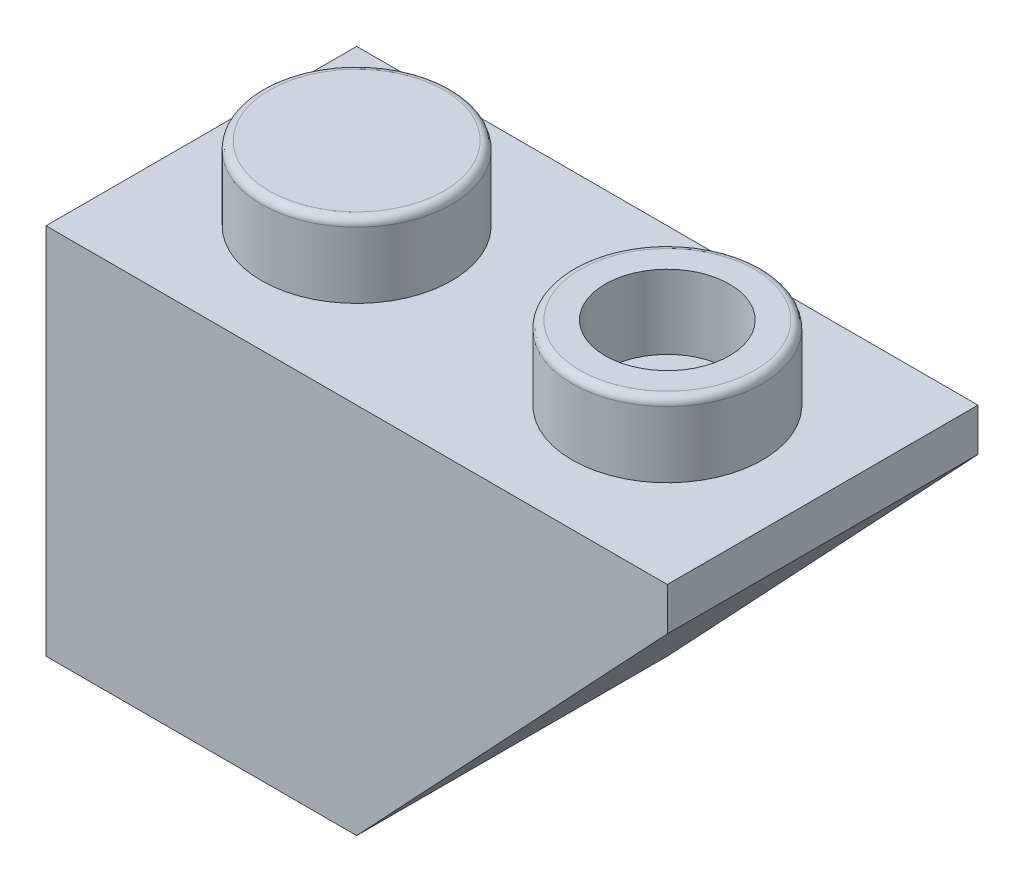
from build123d import *

# Parameters (mm, degrees)
SKIZZE1_W                       = 16
SKIZZE1_H                       = 9.6
LINEAR_AUSTRAGEN1_DEPTH         = 8
SCHNITT_LINEAR_AUSTRAGEN1_DEPTH = 8
SKIZZE3_W                       = 6.8
SKIZZE3_H                       = 6.8
SCHNITT_LINEAR_AUSTRAGEN2_DEPTH = 8.6
SKIZZE4_R                       = 2.45
LINEAR_AUSTRAGEN2_DEPTH         = 1.9
VERRUNDUNG1_R                   = 0.2
SKIZZE5_R                       = 1.25
SCHNITT_LINEAR_AUSTRAGEN3_DEPTH = 1.8
SKIZZE6_R                       = 1.6
SCHNITT_LINEAR_AUSTRAGEN4_DEPTH = 1.9
SKIZZE7_W                       = 0.5
SKIZZE7_H                       = 1
LINEAR_AUSTRAGEN3_DEPTH         = 8.2


with BuildPart() as part:
    # Skizze1 → Linear austragen1 (new body)
    with BuildSketch(Plane.XY):
        with Locations((8, 4.8)):
            Rectangle(SKIZZE1_W, SKIZZE1_H)
    extrude(amount=LINEAR_AUSTRAGEN1_DEPTH)

    # Skizze2 → Schnitt-Linear austragen1 (cut)
    with BuildSketch(Plane.XY.offset(8)):
        Polygon((16, 8.5), (8, 0), (16, 0), align=None)
    extrude(amount=-SCHNITT_LINEAR_AUSTRAGEN1_DEPTH, mode=Mode.SUBTRACT)

    # Skizze3 → Schnitt-Linear austragen2 (cut)
    with BuildSketch(Plane.XZ):
        with Locations((4, 4)):
            Rectangle(SKIZZE3_W, SKIZZE3_H)
    extrude(amount=-SCHNITT_LINEAR_AUSTRAGEN2_DEPTH, mode=Mode.SUBTRACT)

    # Skizze4 → Linear austragen2 (add)
    with BuildSketch(Plane(origin=(0, 9.6, 0), x_dir=(-1, 0, 0), z_dir=(0, 1, 0))):
        with Locations(Location((-12, 4, 0), (0, 0, 270))):
            Circle(SKIZZE4_R)
        with Locations(Location((-4, 4, 0), (0, 0, 270))):
            Circle(SKIZZE4_R)
    extrude(amount=LINEAR_AUSTRAGEN2_DEPTH)

    # Verrundung1
    verrundung1_edges = [part.edges().sort_by_distance(p)[0] for p in [
        (12, 11.5, 6.45),
        (4, 11.5, 6.45),
    ]]
    fillet(verrundung1_edges, radius=VERRUNDUNG1_R)

    # Skizze5 → Schnitt-Linear austragen3 (cut)
    with BuildSketch(Plane.XZ.offset(-8.6)):
        with Locations(Location((4, 4, 0), (0, 0, 270))):
            Circle(SKIZZE5_R)
    extrude(amount=-SCHNITT_LINEAR_AUSTRAGEN3_DEPTH, mode=Mode.SUBTRACT)

    # Skizze6 → Schnitt-Linear austragen4 (cut)
    with BuildSketch(Plane(origin=(0, 11.5, 0), x_dir=(-1, 0, 0), z_dir=(0, 1, 0))):
        with Locations(Location((-12, 4, 0), (0, 0, 90))):
            Circle(SKIZZE6_R)
    extrude(amount=-SCHNITT_LINEAR_AUSTRAGEN4_DEPTH, mode=Mode.SUBTRACT)

    # Skizze7 → Linear austragen3 (add)
    with BuildSketch(Plane.XZ.offset(-8.6)):
        with Locations((7.15, 4)):
            Rectangle(SKIZZE7_W, SKIZZE7_H)
    extrude(amount=LINEAR_AUSTRAGEN3_DEPTH)


solid = part.part
